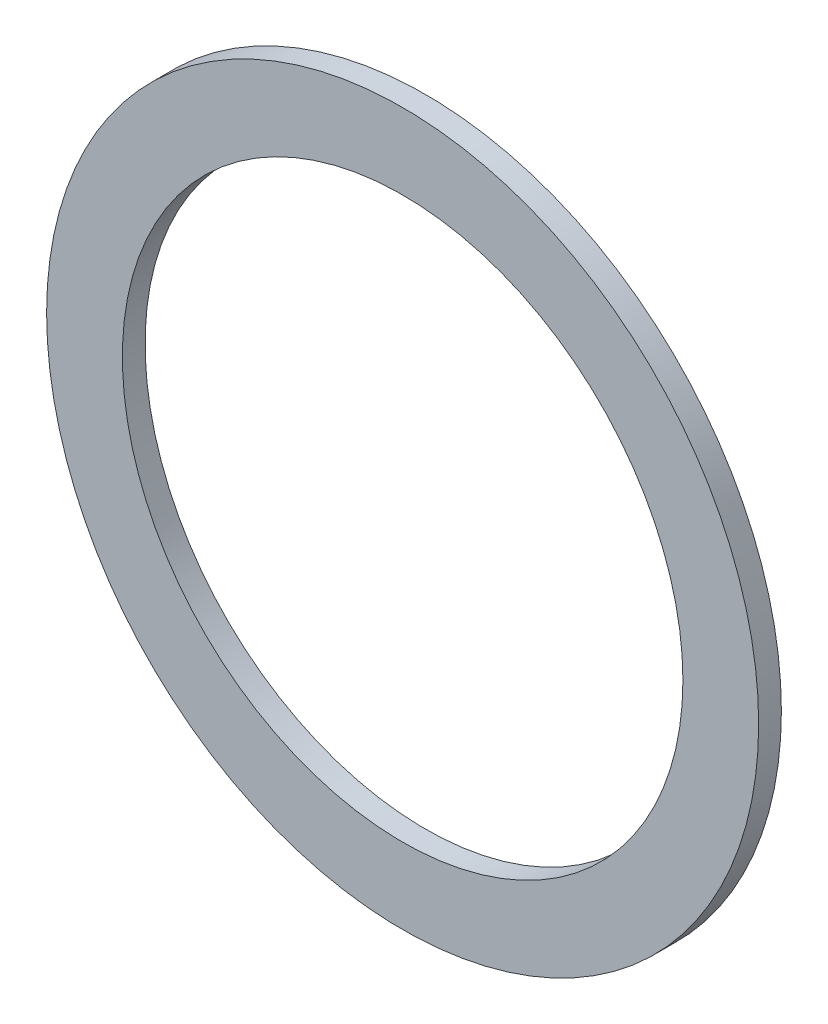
ISO-10303-21;
HEADER;
FILE_DESCRIPTION(('STEP AP214'),'2;1');
FILE_NAME('part.step','',(''),(''),'','','');
FILE_SCHEMA(('AUTOMOTIVE_DESIGN { 1 0 10303 214 1 1 1 1 }'));
ENDSEC;
DATA;
#1=APPLICATION_CONTEXT('core data for automotive mechanical design processes');
#2=APPLICATION_PROTOCOL_DEFINITION('international standard','automotive_design',2000,#1);
#3=PRODUCT_CONTEXT('',#1,'mechanical');
#4=PRODUCT('Part','Part','',(#3));
#5=PRODUCT_RELATED_PRODUCT_CATEGORY('part','',(#4));
#6=PRODUCT_DEFINITION_FORMATION('','',#4);
#7=PRODUCT_DEFINITION_CONTEXT('part definition',#1,'design');
#8=PRODUCT_DEFINITION('design','',#6,#7);
#9=PRODUCT_DEFINITION_SHAPE('','',#8);
#10=(LENGTH_UNIT() NAMED_UNIT(*) SI_UNIT(.MILLI.,.METRE.));
#11=(NAMED_UNIT(*) PLANE_ANGLE_UNIT() SI_UNIT($,.RADIAN.));
#12=(NAMED_UNIT(*) SI_UNIT($,.STERADIAN.) SOLID_ANGLE_UNIT());
#13=UNCERTAINTY_MEASURE_WITH_UNIT(LENGTH_MEASURE(1.E-05),#10,'distance_accuracy_value','');
#14=(GEOMETRIC_REPRESENTATION_CONTEXT(3) GLOBAL_UNCERTAINTY_ASSIGNED_CONTEXT((#13)) GLOBAL_UNIT_ASSIGNED_CONTEXT((#10,
#11,#12)) REPRESENTATION_CONTEXT('',''));
#15=CARTESIAN_POINT('',(0.,0.,0.));
#16=DIRECTION('',(0.,0.,1.));
#17=DIRECTION('',(1.,0.,0.));
#18=AXIS2_PLACEMENT_3D('',#15,#16,#17);
#19=CARTESIAN_POINT('',(0.,0.,1.5));
#20=DIRECTION('',(0.,0.,1.));
#21=DIRECTION('',(1.,0.,0.));
#22=AXIS2_PLACEMENT_3D('',#19,#20,#21);
#23=PLANE('',#22);
#24=CARTESIAN_POINT('',(0.,0.,1.5));
#25=DIRECTION('',(0.,0.,1.));
#26=DIRECTION('',(1.,0.,0.));
#27=AXIS2_PLACEMENT_3D('',#24,#25,#26);
#28=CIRCLE('',#27,23.5);
#29=CARTESIAN_POINT('',(23.5,0.,1.5));
#30=VERTEX_POINT('',#29);
#31=EDGE_CURVE('E10',#30,#30,#28,.T.);
#32=ORIENTED_EDGE('',*,*,#31,.T.);
#33=EDGE_LOOP('',(#32));
#34=FACE_BOUND('',#33,.T.);
#35=CARTESIAN_POINT('',(0.,0.,1.5));
#36=DIRECTION('',(0.,0.,1.));
#37=DIRECTION('',(1.,0.,0.));
#38=AXIS2_PLACEMENT_3D('',#35,#36,#37);
#39=CIRCLE('',#38,18.5);
#40=CARTESIAN_POINT('',(18.5,0.,1.5));
#41=VERTEX_POINT('',#40);
#42=EDGE_CURVE('E33',#41,#41,#39,.T.);
#43=ORIENTED_EDGE('',*,*,#42,.F.);
#44=EDGE_LOOP('',(#43));
#45=FACE_BOUND('',#44,.T.);
#46=ADVANCED_FACE('F22',(#34,#45),#23,.T.);
#47=CARTESIAN_POINT('',(0.,0.,0.));
#48=DIRECTION('',(0.,0.,1.));
#49=DIRECTION('',(1.,0.,0.));
#50=AXIS2_PLACEMENT_3D('',#47,#48,#49);
#51=PLANE('',#50);
#52=CARTESIAN_POINT('',(0.,0.,0.));
#53=DIRECTION('',(0.,0.,1.));
#54=DIRECTION('',(1.,0.,0.));
#55=AXIS2_PLACEMENT_3D('',#52,#53,#54);
#56=CIRCLE('',#55,23.5);
#57=CARTESIAN_POINT('',(23.5,0.,0.));
#58=VERTEX_POINT('',#57);
#59=EDGE_CURVE('E29',#58,#58,#56,.T.);
#60=ORIENTED_EDGE('',*,*,#59,.F.);
#61=EDGE_LOOP('',(#60));
#62=FACE_BOUND('',#61,.T.);
#63=CARTESIAN_POINT('',(0.,0.,0.));
#64=DIRECTION('',(0.,0.,1.));
#65=DIRECTION('',(1.,0.,0.));
#66=AXIS2_PLACEMENT_3D('',#63,#64,#65);
#67=CIRCLE('',#66,18.5);
#68=CARTESIAN_POINT('',(18.5,0.,0.));
#69=VERTEX_POINT('',#68);
#70=EDGE_CURVE('E37',#69,#69,#67,.T.);
#71=ORIENTED_EDGE('',*,*,#70,.T.);
#72=EDGE_LOOP('',(#71));
#73=FACE_BOUND('',#72,.T.);
#74=ADVANCED_FACE('F43',(#62,#73),#51,.F.);
#75=CARTESIAN_POINT('',(0.,0.,1.5));
#76=DIRECTION('',(0.,0.,-1.));
#77=DIRECTION('',(-1.,0.,0.));
#78=AXIS2_PLACEMENT_3D('',#75,#76,#77);
#79=CYLINDRICAL_SURFACE('',#78,23.5);
#80=ORIENTED_EDGE('',*,*,#31,.F.);
#81=EDGE_LOOP('',(#80));
#82=FACE_BOUND('',#81,.T.);
#83=ORIENTED_EDGE('',*,*,#59,.T.);
#84=EDGE_LOOP('',(#83));
#85=FACE_BOUND('',#84,.T.);
#86=ADVANCED_FACE('F24',(#82,#85),#79,.T.);
#87=CARTESIAN_POINT('',(0.,0.,1.5));
#88=DIRECTION('',(0.,0.,-1.));
#89=DIRECTION('',(-1.,0.,0.));
#90=AXIS2_PLACEMENT_3D('',#87,#88,#89);
#91=CYLINDRICAL_SURFACE('',#90,18.5);
#92=ORIENTED_EDGE('',*,*,#42,.T.);
#93=EDGE_LOOP('',(#92));
#94=FACE_BOUND('',#93,.T.);
#95=ORIENTED_EDGE('',*,*,#70,.F.);
#96=EDGE_LOOP('',(#95));
#97=FACE_BOUND('',#96,.T.);
#98=ADVANCED_FACE('F45',(#94,#97),#91,.F.);
#99=CLOSED_SHELL('',(#46,#74,#86,#98));
#100=MANIFOLD_SOLID_BREP('B2',#99);
#101=ADVANCED_BREP_SHAPE_REPRESENTATION('',(#18,#100),#14);
#102=SHAPE_DEFINITION_REPRESENTATION(#9,#101);
ENDSEC;
END-ISO-10303-21;
